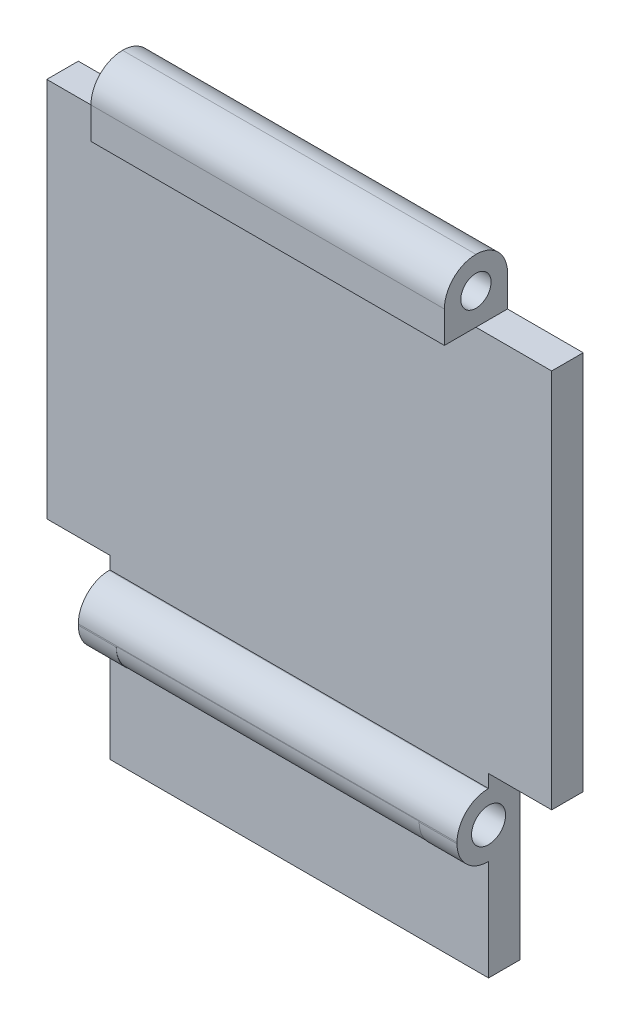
ISO-10303-21;
HEADER;
FILE_DESCRIPTION(('STEP AP214'),'2;1');
FILE_NAME('part.step','',(''),(''),'','','');
FILE_SCHEMA(('AUTOMOTIVE_DESIGN { 1 0 10303 214 1 1 1 1 }'));
ENDSEC;
DATA;
#1=APPLICATION_CONTEXT('core data for automotive mechanical design processes');
#2=APPLICATION_PROTOCOL_DEFINITION('international standard','automotive_design',2000,#1);
#3=PRODUCT_CONTEXT('',#1,'mechanical');
#4=PRODUCT('Part','Part','',(#3));
#5=PRODUCT_RELATED_PRODUCT_CATEGORY('part','',(#4));
#6=PRODUCT_DEFINITION_FORMATION('','',#4);
#7=PRODUCT_DEFINITION_CONTEXT('part definition',#1,'design');
#8=PRODUCT_DEFINITION('design','',#6,#7);
#9=PRODUCT_DEFINITION_SHAPE('','',#8);
#10=(LENGTH_UNIT() NAMED_UNIT(*) SI_UNIT(.MILLI.,.METRE.));
#11=(NAMED_UNIT(*) PLANE_ANGLE_UNIT() SI_UNIT($,.RADIAN.));
#12=(NAMED_UNIT(*) SI_UNIT($,.STERADIAN.) SOLID_ANGLE_UNIT());
#13=UNCERTAINTY_MEASURE_WITH_UNIT(LENGTH_MEASURE(1.E-05),#10,'distance_accuracy_value','');
#14=(GEOMETRIC_REPRESENTATION_CONTEXT(3) GLOBAL_UNCERTAINTY_ASSIGNED_CONTEXT((#13)) GLOBAL_UNIT_ASSIGNED_CONTEXT((#10,
#11,#12)) REPRESENTATION_CONTEXT('',''));
#15=CARTESIAN_POINT('',(0.,0.,0.));
#16=DIRECTION('',(0.,0.,1.));
#17=DIRECTION('',(1.,0.,0.));
#18=AXIS2_PLACEMENT_3D('',#15,#16,#17);
#19=CARTESIAN_POINT('',(12.,-10.5439596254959,2.5));
#20=DIRECTION('',(0.,1.,0.));
#21=DIRECTION('',(0.,0.,1.));
#22=AXIS2_PLACEMENT_3D('',#19,#20,#21);
#23=PLANE('',#22);
#24=DIRECTION('',(0.,0.,1.));
#25=VECTOR('',#24,1.);
#26=CARTESIAN_POINT('',(15.,-10.5439596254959,2.5));
#27=LINE('',#26,#25);
#28=CARTESIAN_POINT('',(15.,-10.5439596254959,0.));
#29=VERTEX_POINT('',#28);
#30=CARTESIAN_POINT('',(15.,-10.5439596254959,2.5));
#31=VERTEX_POINT('',#30);
#32=EDGE_CURVE('E277',#29,#31,#27,.T.);
#33=ORIENTED_EDGE('',*,*,#32,.F.);
#34=DIRECTION('',(-1.,0.,0.));
#35=VECTOR('',#34,1.);
#36=CARTESIAN_POINT('',(0.,-10.5439596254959,0.));
#37=LINE('',#36,#35);
#38=CARTESIAN_POINT('',(20.,-10.5439596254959,0.));
#39=VERTEX_POINT('',#38);
#40=EDGE_CURVE('E332',#39,#29,#37,.T.);
#41=ORIENTED_EDGE('',*,*,#40,.F.);
#42=DIRECTION('',(0.,0.,1.));
#43=VECTOR('',#42,1.);
#44=CARTESIAN_POINT('',(20.,-10.5439596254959,2.5));
#45=LINE('',#44,#43);
#46=CARTESIAN_POINT('',(20.,-10.5439596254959,2.5));
#47=VERTEX_POINT('',#46);
#48=EDGE_CURVE('E327',#39,#47,#45,.T.);
#49=ORIENTED_EDGE('',*,*,#48,.T.);
#50=DIRECTION('',(1.,0.,0.));
#51=VECTOR('',#50,1.);
#52=CARTESIAN_POINT('',(12.,-10.5439596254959,2.5));
#53=LINE('',#52,#51);
#54=EDGE_CURVE('E330',#31,#47,#53,.T.);
#55=ORIENTED_EDGE('',*,*,#54,.F.);
#56=EDGE_LOOP('',(#33,#41,#49,#55));
#57=FACE_BOUND('',#56,.T.);
#58=ADVANCED_FACE('F37',(#57),#23,.F.);
#59=CARTESIAN_POINT('',(0.,0.,2.5));
#60=DIRECTION('',(0.,0.,1.));
#61=DIRECTION('',(1.,0.,0.));
#62=AXIS2_PLACEMENT_3D('',#59,#60,#61);
#63=PLANE('',#62);
#64=DIRECTION('',(1.,0.,0.));
#65=VECTOR('',#64,1.);
#66=CARTESIAN_POINT('',(20.,-24.575,2.5));
#67=LINE('',#66,#65);
#68=CARTESIAN_POINT('',(-15.,-24.575,2.5));
#69=VERTEX_POINT('',#68);
#70=CARTESIAN_POINT('',(15.,-24.575,2.5));
#71=VERTEX_POINT('',#70);
#72=EDGE_CURVE('E236',#69,#71,#67,.T.);
#73=ORIENTED_EDGE('',*,*,#72,.T.);
#74=DIRECTION('',(0.,-1.,0.));
#75=VECTOR('',#74,1.);
#76=CARTESIAN_POINT('',(15.,-24.575,2.5));
#77=LINE('',#76,#75);
#78=CARTESIAN_POINT('',(15.,-16.575,2.5));
#79=VERTEX_POINT('',#78);
#80=EDGE_CURVE('E291',#79,#71,#77,.T.);
#81=ORIENTED_EDGE('',*,*,#80,.F.);
#82=DIRECTION('',(-1.,0.,0.));
#83=VECTOR('',#82,1.);
#84=CARTESIAN_POINT('',(15.,-16.575,2.5));
#85=LINE('',#84,#83);
#86=CARTESIAN_POINT('',(12.,-16.575,2.5));
#87=VERTEX_POINT('',#86);
#88=EDGE_CURVE('E296',#79,#87,#85,.T.);
#89=ORIENTED_EDGE('',*,*,#88,.T.);
#90=DIRECTION('',(1.,0.,0.));
#91=VECTOR('',#90,1.);
#92=CARTESIAN_POINT('',(0.,-16.575,2.5));
#93=LINE('',#92,#91);
#94=CARTESIAN_POINT('',(-12.,-16.575,2.5));
#95=VERTEX_POINT('',#94);
#96=EDGE_CURVE('E317',#95,#87,#93,.T.);
#97=ORIENTED_EDGE('',*,*,#96,.F.);
#98=DIRECTION('',(1.,0.,0.));
#99=VECTOR('',#98,1.);
#100=CARTESIAN_POINT('',(-15.,-16.575,2.5));
#101=LINE('',#100,#99);
#102=CARTESIAN_POINT('',(-15.,-16.575,2.5));
#103=VERTEX_POINT('',#102);
#104=EDGE_CURVE('E269',#103,#95,#101,.T.);
#105=ORIENTED_EDGE('',*,*,#104,.F.);
#106=DIRECTION('',(0.,1.,0.));
#107=VECTOR('',#106,1.);
#108=CARTESIAN_POINT('',(-15.,-24.575,2.5));
#109=LINE('',#108,#107);
#110=EDGE_CURVE('E239',#69,#103,#109,.T.);
#111=ORIENTED_EDGE('',*,*,#110,.F.);
#112=EDGE_LOOP('',(#73,#81,#89,#97,#105,#111));
#113=FACE_BOUND('',#112,.T.);
#114=ADVANCED_FACE('F461',(#113),#63,.T.);
#115=CARTESIAN_POINT('',(20.,-24.575,5.));
#116=DIRECTION('',(-1.,0.,0.));
#117=DIRECTION('',(0.,0.,1.));
#118=AXIS2_PLACEMENT_3D('',#115,#116,#117);
#119=PLANE('',#118);
#120=DIRECTION('',(0.,1.,0.));
#121=VECTOR('',#120,1.);
#122=CARTESIAN_POINT('',(20.,19.575,2.5));
#123=LINE('',#122,#121);
#124=CARTESIAN_POINT('',(20.,19.575,2.5));
#125=VERTEX_POINT('',#124);
#126=EDGE_CURVE('E351',#47,#125,#123,.T.);
#127=ORIENTED_EDGE('',*,*,#126,.F.);
#128=ORIENTED_EDGE('',*,*,#48,.F.);
#129=DIRECTION('',(0.,1.,0.));
#130=VECTOR('',#129,1.);
#131=CARTESIAN_POINT('',(20.,-24.575,0.));
#132=LINE('',#131,#130);
#133=CARTESIAN_POINT('',(20.,19.575,0.));
#134=VERTEX_POINT('',#133);
#135=EDGE_CURVE('E230',#39,#134,#132,.T.);
#136=ORIENTED_EDGE('',*,*,#135,.T.);
#137=DIRECTION('',(0.,0.,-1.));
#138=VECTOR('',#137,1.);
#139=CARTESIAN_POINT('',(20.,19.575,5.));
#140=LINE('',#139,#138);
#141=EDGE_CURVE('E380',#125,#134,#140,.T.);
#142=ORIENTED_EDGE('',*,*,#141,.F.);
#143=EDGE_LOOP('',(#127,#128,#136,#142));
#144=FACE_BOUND('',#143,.T.);
#145=ADVANCED_FACE('F543',(#144),#119,.F.);
#146=CARTESIAN_POINT('',(20.,-24.575,5.));
#147=DIRECTION('',(0.,1.,0.));
#148=DIRECTION('',(-1.,0.,0.));
#149=AXIS2_PLACEMENT_3D('',#146,#147,#148);
#150=PLANE('',#149);
#151=DIRECTION('',(1.,0.,0.));
#152=VECTOR('',#151,1.);
#153=CARTESIAN_POINT('',(20.,-24.575,0.));
#154=LINE('',#153,#152);
#155=CARTESIAN_POINT('',(-15.,-24.575,0.));
#156=VERTEX_POINT('',#155);
#157=CARTESIAN_POINT('',(15.,-24.575,0.));
#158=VERTEX_POINT('',#157);
#159=EDGE_CURVE('E219',#156,#158,#154,.T.);
#160=ORIENTED_EDGE('',*,*,#159,.T.);
#161=DIRECTION('',(0.,0.,-1.));
#162=VECTOR('',#161,1.);
#163=CARTESIAN_POINT('',(15.,-24.575,0.));
#164=LINE('',#163,#162);
#165=EDGE_CURVE('E294',#71,#158,#164,.T.);
#166=ORIENTED_EDGE('',*,*,#165,.F.);
#167=ORIENTED_EDGE('',*,*,#72,.F.);
#168=DIRECTION('',(0.,0.,1.));
#169=VECTOR('',#168,1.);
#170=CARTESIAN_POINT('',(-15.,-24.575,0.));
#171=LINE('',#170,#169);
#172=EDGE_CURVE('E234',#156,#69,#171,.T.);
#173=ORIENTED_EDGE('',*,*,#172,.F.);
#174=EDGE_LOOP('',(#160,#166,#167,#173));
#175=FACE_BOUND('',#174,.T.);
#176=ADVANCED_FACE('F235',(#175),#150,.F.);
#177=CARTESIAN_POINT('',(20.,19.575,5.));
#178=DIRECTION('',(0.,1.,0.));
#179=DIRECTION('',(0.,0.,1.));
#180=AXIS2_PLACEMENT_3D('',#177,#178,#179);
#181=PLANE('',#180);
#182=DIRECTION('',(0.,0.,-1.));
#183=VECTOR('',#182,1.);
#184=CARTESIAN_POINT('',(14.,19.575,5.));
#185=LINE('',#184,#183);
#186=CARTESIAN_POINT('',(14.,19.575,2.5));
#187=VERTEX_POINT('',#186);
#188=CARTESIAN_POINT('',(14.,19.575,0.));
#189=VERTEX_POINT('',#188);
#190=EDGE_CURVE('E388',#187,#189,#185,.T.);
#191=ORIENTED_EDGE('',*,*,#190,.F.);
#192=DIRECTION('',(-1.,0.,0.));
#193=VECTOR('',#192,1.);
#194=CARTESIAN_POINT('',(20.,19.575,2.5));
#195=LINE('',#194,#193);
#196=EDGE_CURVE('E343',#125,#187,#195,.T.);
#197=ORIENTED_EDGE('',*,*,#196,.F.);
#198=ORIENTED_EDGE('',*,*,#141,.T.);
#199=DIRECTION('',(1.,0.,0.));
#200=VECTOR('',#199,1.);
#201=CARTESIAN_POINT('',(20.,19.575,0.));
#202=LINE('',#201,#200);
#203=EDGE_CURVE('E381',#189,#134,#202,.T.);
#204=ORIENTED_EDGE('',*,*,#203,.F.);
#205=EDGE_LOOP('',(#191,#197,#198,#204));
#206=FACE_BOUND('',#205,.T.);
#207=ADVANCED_FACE('F539',(#206),#181,.T.);
#208=CARTESIAN_POINT('',(-20.,-24.575,5.));
#209=DIRECTION('',(1.,0.,0.));
#210=DIRECTION('',(0.,0.,-1.));
#211=AXIS2_PLACEMENT_3D('',#208,#209,#210);
#212=PLANE('',#211);
#213=DIRECTION('',(0.,-1.,0.));
#214=VECTOR('',#213,1.);
#215=CARTESIAN_POINT('',(-20.,-24.575,0.));
#216=LINE('',#215,#214);
#217=CARTESIAN_POINT('',(-20.,19.5799216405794,0.));
#218=VERTEX_POINT('',#217);
#219=CARTESIAN_POINT('',(-20.,-10.575,0.));
#220=VERTEX_POINT('',#219);
#221=EDGE_CURVE('E231',#218,#220,#216,.T.);
#222=ORIENTED_EDGE('',*,*,#221,.T.);
#223=DIRECTION('',(0.,0.,-1.));
#224=VECTOR('',#223,1.);
#225=CARTESIAN_POINT('',(-20.,-10.575,2.49999999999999));
#226=LINE('',#225,#224);
#227=CARTESIAN_POINT('',(-20.,-10.575,2.49999999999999));
#228=VERTEX_POINT('',#227);
#229=EDGE_CURVE('E320',#228,#220,#226,.T.);
#230=ORIENTED_EDGE('',*,*,#229,.F.);
#231=DIRECTION('',(0.,-1.,0.));
#232=VECTOR('',#231,1.);
#233=CARTESIAN_POINT('',(-19.9999995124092,19.575,2.5));
#234=LINE('',#233,#232);
#235=CARTESIAN_POINT('',(-20.,19.5799216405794,2.5));
#236=VERTEX_POINT('',#235);
#237=EDGE_CURVE('E346',#236,#228,#234,.T.);
#238=ORIENTED_EDGE('',*,*,#237,.F.);
#239=DIRECTION('',(0.,0.,-1.));
#240=VECTOR('',#239,1.);
#241=CARTESIAN_POINT('',(-20.,19.5799216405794,5.));
#242=LINE('',#241,#240);
#243=EDGE_CURVE('E375',#236,#218,#242,.T.);
#244=ORIENTED_EDGE('',*,*,#243,.T.);
#245=EDGE_LOOP('',(#222,#230,#238,#244));
#246=FACE_BOUND('',#245,.T.);
#247=ADVANCED_FACE('F502',(#246),#212,.F.);
#248=CARTESIAN_POINT('',(0.,0.,5.));
#249=DIRECTION('',(0.,0.,1.));
#250=DIRECTION('',(1.,0.,0.));
#251=AXIS2_PLACEMENT_3D('',#248,#249,#250);
#252=PLANE('',#251);
#253=DIRECTION('',(0.,1.,0.));
#254=VECTOR('',#253,1.);
#255=CARTESIAN_POINT('',(-14.,24.575,5.));
#256=LINE('',#255,#254);
#257=CARTESIAN_POINT('',(-14.,19.575,5.));
#258=VERTEX_POINT('',#257);
#259=CARTESIAN_POINT('',(-14.,22.075,5.));
#260=VERTEX_POINT('',#259);
#261=EDGE_CURVE('E363',#258,#260,#256,.T.);
#262=ORIENTED_EDGE('',*,*,#261,.F.);
#263=DIRECTION('',(-1.,0.,0.));
#264=VECTOR('',#263,1.);
#265=CARTESIAN_POINT('',(20.,19.575,5.));
#266=LINE('',#265,#264);
#267=CARTESIAN_POINT('',(14.,19.575,5.));
#268=VERTEX_POINT('',#267);
#269=EDGE_CURVE('E342',#268,#258,#266,.T.);
#270=ORIENTED_EDGE('',*,*,#269,.F.);
#271=DIRECTION('',(0.,-1.,0.));
#272=VECTOR('',#271,1.);
#273=CARTESIAN_POINT('',(14.,24.575,5.));
#274=LINE('',#273,#272);
#275=CARTESIAN_POINT('',(14.,22.075,5.));
#276=VERTEX_POINT('',#275);
#277=EDGE_CURVE('E377',#276,#268,#274,.T.);
#278=ORIENTED_EDGE('',*,*,#277,.F.);
#279=DIRECTION('',(-1.,0.,0.));
#280=VECTOR('',#279,1.);
#281=CARTESIAN_POINT('',(-14.,22.075,5.));
#282=LINE('',#281,#280);
#283=EDGE_CURVE('E394',#276,#260,#282,.T.);
#284=ORIENTED_EDGE('',*,*,#283,.T.);
#285=EDGE_LOOP('',(#262,#270,#278,#284));
#286=FACE_BOUND('',#285,.T.);
#287=ADVANCED_FACE('F529',(#286),#252,.T.);
#288=CARTESIAN_POINT('',(0.,0.,0.));
#289=DIRECTION('',(0.,0.,1.));
#290=DIRECTION('',(1.,0.,0.));
#291=AXIS2_PLACEMENT_3D('',#288,#289,#290);
#292=PLANE('',#291);
#293=DIRECTION('',(0.,-1.,0.));
#294=VECTOR('',#293,1.);
#295=CARTESIAN_POINT('',(-15.,-10.575,0.));
#296=LINE('',#295,#294);
#297=CARTESIAN_POINT('',(-15.,-10.575,0.));
#298=VERTEX_POINT('',#297);
#299=EDGE_CURVE('E223',#298,#156,#296,.T.);
#300=ORIENTED_EDGE('',*,*,#299,.F.);
#301=DIRECTION('',(-1.,0.,0.));
#302=VECTOR('',#301,1.);
#303=CARTESIAN_POINT('',(0.,-10.575,0.));
#304=LINE('',#303,#302);
#305=EDGE_CURVE('E325',#298,#220,#304,.T.);
#306=ORIENTED_EDGE('',*,*,#305,.T.);
#307=ORIENTED_EDGE('',*,*,#221,.F.);
#308=DIRECTION('',(1.,0.,0.));
#309=VECTOR('',#308,1.);
#310=CARTESIAN_POINT('',(-20.,19.5799216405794,0.));
#311=LINE('',#310,#309);
#312=CARTESIAN_POINT('',(-14.,19.5799216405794,0.));
#313=VERTEX_POINT('',#312);
#314=EDGE_CURVE('E368',#218,#313,#311,.T.);
#315=ORIENTED_EDGE('',*,*,#314,.T.);
#316=DIRECTION('',(0.,1.,0.));
#317=VECTOR('',#316,1.);
#318=CARTESIAN_POINT('',(-14.,24.575,0.));
#319=LINE('',#318,#317);
#320=CARTESIAN_POINT('',(-14.,22.075,0.));
#321=VERTEX_POINT('',#320);
#322=EDGE_CURVE('E367',#313,#321,#319,.T.);
#323=ORIENTED_EDGE('',*,*,#322,.T.);
#324=DIRECTION('',(-1.,0.,0.));
#325=VECTOR('',#324,1.);
#326=CARTESIAN_POINT('',(0.,22.075,0.));
#327=LINE('',#326,#325);
#328=CARTESIAN_POINT('',(14.,22.075,0.));
#329=VERTEX_POINT('',#328);
#330=EDGE_CURVE('E405',#321,#329,#327,.F.);
#331=ORIENTED_EDGE('',*,*,#330,.T.);
#332=DIRECTION('',(0.,-1.,0.));
#333=VECTOR('',#332,1.);
#334=CARTESIAN_POINT('',(14.,24.575,0.));
#335=LINE('',#334,#333);
#336=EDGE_CURVE('E362',#329,#189,#335,.T.);
#337=ORIENTED_EDGE('',*,*,#336,.T.);
#338=ORIENTED_EDGE('',*,*,#203,.T.);
#339=ORIENTED_EDGE('',*,*,#135,.F.);
#340=ORIENTED_EDGE('',*,*,#40,.T.);
#341=DIRECTION('',(0.,1.,0.));
#342=VECTOR('',#341,1.);
#343=CARTESIAN_POINT('',(15.,-10.5439596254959,0.));
#344=LINE('',#343,#342);
#345=EDGE_CURVE('E226',#158,#29,#344,.T.);
#346=ORIENTED_EDGE('',*,*,#345,.F.);
#347=ORIENTED_EDGE('',*,*,#159,.F.);
#348=EDGE_LOOP('',(#300,#306,#307,#315,#323,#331,#337,#338,#339,#340,#346,#347));
#349=FACE_BOUND('',#348,.T.);
#350=ADVANCED_FACE('F221',(#349),#292,.F.);
#351=CARTESIAN_POINT('',(14.,24.575,5.));
#352=DIRECTION('',(1.,0.,0.));
#353=DIRECTION('',(0.,1.,0.));
#354=AXIS2_PLACEMENT_3D('',#351,#352,#353);
#355=PLANE('',#354);
#356=CARTESIAN_POINT('',(14.,22.075,2.5));
#357=DIRECTION('',(1.,0.,0.));
#358=DIRECTION('',(0.,1.,0.));
#359=AXIS2_PLACEMENT_3D('',#356,#357,#358);
#360=CIRCLE('',#359,1.2);
#361=CARTESIAN_POINT('',(14.,23.275,2.5));
#362=VERTEX_POINT('',#361);
#363=EDGE_CURVE('E359',#362,#362,#360,.T.);
#364=ORIENTED_EDGE('',*,*,#363,.F.);
#365=EDGE_LOOP('',(#364));
#366=FACE_BOUND('',#365,.T.);
#367=CARTESIAN_POINT('',(14.,22.075,2.5));
#368=DIRECTION('',(1.,0.,0.));
#369=DIRECTION('',(0.,1.,0.));
#370=AXIS2_PLACEMENT_3D('',#367,#368,#369);
#371=CIRCLE('',#370,2.5);
#372=CARTESIAN_POINT('',(14.,24.575,2.5));
#373=VERTEX_POINT('',#372);
#374=EDGE_CURVE('E401',#329,#373,#371,.T.);
#375=ORIENTED_EDGE('',*,*,#374,.T.);
#376=CARTESIAN_POINT('',(14.,22.075,2.5));
#377=DIRECTION('',(1.,0.,0.));
#378=DIRECTION('',(0.,1.,0.));
#379=AXIS2_PLACEMENT_3D('',#376,#377,#378);
#380=CIRCLE('',#379,2.5);
#381=EDGE_CURVE('E403',#373,#276,#380,.T.);
#382=ORIENTED_EDGE('',*,*,#381,.T.);
#383=ORIENTED_EDGE('',*,*,#277,.T.);
#384=EDGE_CURVE('E371',#268,#187,#185,.T.);
#385=ORIENTED_EDGE('',*,*,#384,.T.);
#386=ORIENTED_EDGE('',*,*,#190,.T.);
#387=ORIENTED_EDGE('',*,*,#336,.F.);
#388=EDGE_LOOP('',(#375,#382,#383,#385,#386,#387));
#389=FACE_BOUND('',#388,.T.);
#390=ADVANCED_FACE('F525',(#366,#389),#355,.T.);
#391=CARTESIAN_POINT('',(-20.,19.5799216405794,5.));
#392=DIRECTION('',(0.,1.,0.));
#393=DIRECTION('',(0.,0.,1.));
#394=AXIS2_PLACEMENT_3D('',#391,#392,#393);
#395=PLANE('',#394);
#396=DIRECTION('',(-1.,0.,0.));
#397=VECTOR('',#396,1.);
#398=CARTESIAN_POINT('',(-20.,19.5799216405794,2.5));
#399=LINE('',#398,#397);
#400=CARTESIAN_POINT('',(-14.,19.5799216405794,2.5));
#401=VERTEX_POINT('',#400);
#402=EDGE_CURVE('E334',#401,#236,#399,.T.);
#403=ORIENTED_EDGE('',*,*,#402,.F.);
#404=DIRECTION('',(0.,0.,-1.));
#405=VECTOR('',#404,1.);
#406=CARTESIAN_POINT('',(-14.,19.5799216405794,5.));
#407=LINE('',#406,#405);
#408=EDGE_CURVE('E366',#401,#313,#407,.T.);
#409=ORIENTED_EDGE('',*,*,#408,.T.);
#410=ORIENTED_EDGE('',*,*,#314,.F.);
#411=ORIENTED_EDGE('',*,*,#243,.F.);
#412=EDGE_LOOP('',(#403,#409,#410,#411));
#413=FACE_BOUND('',#412,.T.);
#414=ADVANCED_FACE('F510',(#413),#395,.T.);
#415=CARTESIAN_POINT('',(-14.,24.575,5.));
#416=DIRECTION('',(-1.,0.,0.));
#417=DIRECTION('',(0.,-1.,0.));
#418=AXIS2_PLACEMENT_3D('',#415,#416,#417);
#419=PLANE('',#418);
#420=CARTESIAN_POINT('',(-14.,22.075,2.5));
#421=DIRECTION('',(-1.,0.,0.));
#422=DIRECTION('',(0.,0.,1.));
#423=AXIS2_PLACEMENT_3D('',#420,#421,#422);
#424=CIRCLE('',#423,1.2);
#425=CARTESIAN_POINT('',(-14.,22.075,3.7));
#426=VERTEX_POINT('',#425);
#427=EDGE_CURVE('E356',#426,#426,#424,.T.);
#428=ORIENTED_EDGE('',*,*,#427,.F.);
#429=EDGE_LOOP('',(#428));
#430=FACE_BOUND('',#429,.T.);
#431=ORIENTED_EDGE('',*,*,#261,.T.);
#432=CARTESIAN_POINT('',(-14.,22.075,2.5));
#433=DIRECTION('',(-1.,0.,0.));
#434=DIRECTION('',(0.,-1.,0.));
#435=AXIS2_PLACEMENT_3D('',#432,#433,#434);
#436=CIRCLE('',#435,2.5);
#437=CARTESIAN_POINT('',(-14.,24.575,2.5));
#438=VERTEX_POINT('',#437);
#439=EDGE_CURVE('E399',#260,#438,#436,.T.);
#440=ORIENTED_EDGE('',*,*,#439,.T.);
#441=CARTESIAN_POINT('',(-14.,22.075,2.5));
#442=DIRECTION('',(-1.,0.,0.));
#443=DIRECTION('',(0.,-1.,0.));
#444=AXIS2_PLACEMENT_3D('',#441,#442,#443);
#445=CIRCLE('',#444,2.5);
#446=EDGE_CURVE('E397',#438,#321,#445,.T.);
#447=ORIENTED_EDGE('',*,*,#446,.T.);
#448=ORIENTED_EDGE('',*,*,#322,.F.);
#449=ORIENTED_EDGE('',*,*,#408,.F.);
#450=DIRECTION('',(0.,1.,0.));
#451=VECTOR('',#450,1.);
#452=CARTESIAN_POINT('',(-14.,19.5699216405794,2.5));
#453=LINE('',#452,#451);
#454=CARTESIAN_POINT('',(-14.,19.575,2.5));
#455=VERTEX_POINT('',#454);
#456=EDGE_CURVE('E337',#455,#401,#453,.T.);
#457=ORIENTED_EDGE('',*,*,#456,.F.);
#458=DIRECTION('',(0.,0.,-1.));
#459=VECTOR('',#458,1.);
#460=CARTESIAN_POINT('',(-14.,19.575,2.49999999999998));
#461=LINE('',#460,#459);
#462=EDGE_CURVE('E339',#258,#455,#461,.T.);
#463=ORIENTED_EDGE('',*,*,#462,.F.);
#464=EDGE_LOOP('',(#431,#440,#447,#448,#449,#457,#463));
#465=FACE_BOUND('',#464,.T.);
#466=ADVANCED_FACE('F513',(#430,#465),#419,.T.);
#467=CARTESIAN_POINT('',(18.,22.075,2.5));
#468=DIRECTION('',(-1.,0.,0.));
#469=DIRECTION('',(0.,0.,1.));
#470=AXIS2_PLACEMENT_3D('',#467,#468,#469);
#471=CYLINDRICAL_SURFACE('',#470,1.2);
#472=ORIENTED_EDGE('',*,*,#363,.T.);
#473=EDGE_LOOP('',(#472));
#474=FACE_BOUND('',#473,.T.);
#475=ORIENTED_EDGE('',*,*,#427,.T.);
#476=EDGE_LOOP('',(#475));
#477=FACE_BOUND('',#476,.T.);
#478=ADVANCED_FACE('F583',(#474,#477),#471,.F.);
#479=CARTESIAN_POINT('',(20.,22.075,2.5));
#480=DIRECTION('',(-1.,0.,0.));
#481=DIRECTION('',(0.,-1.,0.));
#482=AXIS2_PLACEMENT_3D('',#479,#480,#481);
#483=CYLINDRICAL_SURFACE('',#482,2.5);
#484=DIRECTION('',(-1.,0.,0.));
#485=VECTOR('',#484,1.);
#486=CARTESIAN_POINT('',(20.,24.575,2.5));
#487=LINE('',#486,#485);
#488=EDGE_CURVE('E353',#373,#438,#487,.T.);
#489=ORIENTED_EDGE('',*,*,#488,.F.);
#490=ORIENTED_EDGE('',*,*,#374,.F.);
#491=ORIENTED_EDGE('',*,*,#330,.F.);
#492=ORIENTED_EDGE('',*,*,#446,.F.);
#493=EDGE_LOOP('',(#489,#490,#491,#492));
#494=FACE_BOUND('',#493,.T.);
#495=ADVANCED_FACE('F517',(#494),#483,.T.);
#496=CARTESIAN_POINT('',(0.,22.075,2.5));
#497=DIRECTION('',(1.,0.,0.));
#498=DIRECTION('',(0.,1.,0.));
#499=AXIS2_PLACEMENT_3D('',#496,#497,#498);
#500=CYLINDRICAL_SURFACE('',#499,2.5);
#501=ORIENTED_EDGE('',*,*,#381,.F.);
#502=ORIENTED_EDGE('',*,*,#488,.T.);
#503=ORIENTED_EDGE('',*,*,#439,.F.);
#504=ORIENTED_EDGE('',*,*,#283,.F.);
#505=EDGE_LOOP('',(#501,#502,#503,#504));
#506=FACE_BOUND('',#505,.T.);
#507=ADVANCED_FACE('F521',(#506),#500,.T.);
#508=CARTESIAN_POINT('',(20.,19.575,2.5));
#509=DIRECTION('',(0.,1.,0.));
#510=DIRECTION('',(-1.,0.,0.));
#511=AXIS2_PLACEMENT_3D('',#508,#509,#510);
#512=PLANE('',#511);
#513=ORIENTED_EDGE('',*,*,#269,.T.);
#514=ORIENTED_EDGE('',*,*,#462,.T.);
#515=EDGE_CURVE('E347',#187,#455,#195,.T.);
#516=ORIENTED_EDGE('',*,*,#515,.F.);
#517=ORIENTED_EDGE('',*,*,#384,.F.);
#518=EDGE_LOOP('',(#513,#514,#516,#517));
#519=FACE_BOUND('',#518,.T.);
#520=ADVANCED_FACE('F532',(#519),#512,.F.);
#521=DIRECTION('',(-1.,0.,0.));
#522=VECTOR('',#521,1.);
#523=CARTESIAN_POINT('',(-12.,-10.575,2.49999999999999));
#524=LINE('',#523,#522);
#525=CARTESIAN_POINT('',(-15.,-10.575,2.49999999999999));
#526=VERTEX_POINT('',#525);
#527=EDGE_CURVE('E323',#526,#228,#524,.T.);
#528=ORIENTED_EDGE('',*,*,#527,.F.);
#529=DIRECTION('',(0.,1.,0.));
#530=VECTOR('',#529,1.);
#531=CARTESIAN_POINT('',(-15.,-11.5775410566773,2.5));
#532=LINE('',#531,#530);
#533=CARTESIAN_POINT('',(-15.,-11.5775410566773,2.5));
#534=VERTEX_POINT('',#533);
#535=EDGE_CURVE('E260',#534,#526,#532,.T.);
#536=ORIENTED_EDGE('',*,*,#535,.F.);
#537=DIRECTION('',(1.,0.,0.));
#538=VECTOR('',#537,1.);
#539=CARTESIAN_POINT('',(-15.,-11.5775410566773,2.5));
#540=LINE('',#539,#538);
#541=CARTESIAN_POINT('',(-12.,-11.5775410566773,2.5));
#542=VERTEX_POINT('',#541);
#543=EDGE_CURVE('E263',#534,#542,#540,.T.);
#544=ORIENTED_EDGE('',*,*,#543,.T.);
#545=DIRECTION('',(-1.,0.,0.));
#546=VECTOR('',#545,1.);
#547=CARTESIAN_POINT('',(0.,-11.5775410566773,2.5));
#548=LINE('',#547,#546);
#549=CARTESIAN_POINT('',(12.,-11.5775410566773,2.5));
#550=VERTEX_POINT('',#549);
#551=EDGE_CURVE('E312',#550,#542,#548,.T.);
#552=ORIENTED_EDGE('',*,*,#551,.F.);
#553=DIRECTION('',(-1.,0.,0.));
#554=VECTOR('',#553,1.);
#555=CARTESIAN_POINT('',(15.,-11.5775410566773,2.5));
#556=LINE('',#555,#554);
#557=CARTESIAN_POINT('',(15.,-11.5775410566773,2.5));
#558=VERTEX_POINT('',#557);
#559=EDGE_CURVE('E305',#558,#550,#556,.T.);
#560=ORIENTED_EDGE('',*,*,#559,.F.);
#561=DIRECTION('',(0.,-1.,0.));
#562=VECTOR('',#561,1.);
#563=CARTESIAN_POINT('',(15.,-11.5775410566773,2.5));
#564=LINE('',#563,#562);
#565=EDGE_CURVE('E281',#31,#558,#564,.T.);
#566=ORIENTED_EDGE('',*,*,#565,.F.);
#567=ORIENTED_EDGE('',*,*,#54,.T.);
#568=ORIENTED_EDGE('',*,*,#126,.T.);
#569=ORIENTED_EDGE('',*,*,#196,.T.);
#570=ORIENTED_EDGE('',*,*,#515,.T.);
#571=ORIENTED_EDGE('',*,*,#456,.T.);
#572=ORIENTED_EDGE('',*,*,#402,.T.);
#573=ORIENTED_EDGE('',*,*,#237,.T.);
#574=EDGE_LOOP('',(#528,#536,#544,#552,#560,#566,#567,#568,#569,#570,#571,#572,#573));
#575=FACE_BOUND('',#574,.T.);
#576=ADVANCED_FACE('F497',(#575),#63,.T.);
#577=CARTESIAN_POINT('',(-12.,-10.575,2.49999999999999));
#578=DIRECTION('',(0.,1.,0.));
#579=DIRECTION('',(0.,0.,1.));
#580=AXIS2_PLACEMENT_3D('',#577,#578,#579);
#581=PLANE('',#580);
#582=ORIENTED_EDGE('',*,*,#305,.F.);
#583=DIRECTION('',(0.,0.,-1.));
#584=VECTOR('',#583,1.);
#585=CARTESIAN_POINT('',(-15.,-10.575,2.49999999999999));
#586=LINE('',#585,#584);
#587=EDGE_CURVE('E245',#526,#298,#586,.T.);
#588=ORIENTED_EDGE('',*,*,#587,.F.);
#589=ORIENTED_EDGE('',*,*,#527,.T.);
#590=ORIENTED_EDGE('',*,*,#229,.T.);
#591=EDGE_LOOP('',(#582,#588,#589,#590));
#592=FACE_BOUND('',#591,.T.);
#593=ADVANCED_FACE('F500',(#592),#581,.F.);
#594=CARTESIAN_POINT('',(-12.,-16.575,5.));
#595=DIRECTION('',(0.,0.,1.));
#596=DIRECTION('',(1.,0.,0.));
#597=AXIS2_PLACEMENT_3D('',#594,#595,#596);
#598=PLANE('',#597);
#599=DIRECTION('',(0.,1.,0.));
#600=VECTOR('',#599,1.);
#601=CARTESIAN_POINT('',(-15.,-16.575,5.));
#602=LINE('',#601,#600);
#603=CARTESIAN_POINT('',(-15.,-14.125,5.));
#604=VERTEX_POINT('',#603);
#605=CARTESIAN_POINT('',(-15.,-14.0275122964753,5.));
#606=VERTEX_POINT('',#605);
#607=EDGE_CURVE('E256',#604,#606,#602,.T.);
#608=ORIENTED_EDGE('',*,*,#607,.F.);
#609=DIRECTION('',(1.,0.,0.));
#610=VECTOR('',#609,1.);
#611=CARTESIAN_POINT('',(-12.,-14.125,5.));
#612=LINE('',#611,#610);
#613=CARTESIAN_POINT('',(-12.,-14.125,5.));
#614=VERTEX_POINT('',#613);
#615=EDGE_CURVE('E444',#604,#614,#612,.T.);
#616=ORIENTED_EDGE('',*,*,#615,.T.);
#617=DIRECTION('',(0.,1.,0.));
#618=VECTOR('',#617,1.);
#619=CARTESIAN_POINT('',(-12.,-16.575,5.));
#620=LINE('',#619,#618);
#621=CARTESIAN_POINT('',(-12.,-14.075,5.));
#622=VERTEX_POINT('',#621);
#623=EDGE_CURVE('E248',#614,#622,#620,.T.);
#624=ORIENTED_EDGE('',*,*,#623,.T.);
#625=DIRECTION('',(1.,0.,0.));
#626=VECTOR('',#625,1.);
#627=CARTESIAN_POINT('',(-12.,-14.075,5.));
#628=LINE('',#627,#626);
#629=CARTESIAN_POINT('',(12.,-14.075,5.));
#630=VERTEX_POINT('',#629);
#631=EDGE_CURVE('E412',#622,#630,#628,.T.);
#632=ORIENTED_EDGE('',*,*,#631,.T.);
#633=DIRECTION('',(0.,-1.,0.));
#634=VECTOR('',#633,1.);
#635=CARTESIAN_POINT('',(12.,-16.575,5.));
#636=LINE('',#635,#634);
#637=CARTESIAN_POINT('',(12.,-14.125,5.));
#638=VERTEX_POINT('',#637);
#639=EDGE_CURVE('E299',#630,#638,#636,.T.);
#640=ORIENTED_EDGE('',*,*,#639,.T.);
#641=DIRECTION('',(-1.,0.,0.));
#642=VECTOR('',#641,1.);
#643=CARTESIAN_POINT('',(15.,-14.125,5.));
#644=LINE('',#643,#642);
#645=CARTESIAN_POINT('',(15.,-14.125,5.));
#646=VERTEX_POINT('',#645);
#647=EDGE_CURVE('E418',#638,#646,#644,.F.);
#648=ORIENTED_EDGE('',*,*,#647,.T.);
#649=DIRECTION('',(0.,-1.,0.));
#650=VECTOR('',#649,1.);
#651=CARTESIAN_POINT('',(15.,-16.575,5.));
#652=LINE('',#651,#650);
#653=CARTESIAN_POINT('',(15.,-14.0275122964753,5.));
#654=VERTEX_POINT('',#653);
#655=EDGE_CURVE('E286',#654,#646,#652,.T.);
#656=ORIENTED_EDGE('',*,*,#655,.F.);
#657=DIRECTION('',(-1.,0.,0.));
#658=VECTOR('',#657,1.);
#659=CARTESIAN_POINT('',(12.,-14.0275122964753,5.));
#660=LINE('',#659,#658);
#661=EDGE_CURVE('E420',#654,#606,#660,.T.);
#662=ORIENTED_EDGE('',*,*,#661,.T.);
#663=EDGE_LOOP('',(#608,#616,#624,#632,#640,#648,#656,#662));
#664=FACE_BOUND('',#663,.T.);
#665=ADVANCED_FACE('F450',(#664),#598,.T.);
#666=CARTESIAN_POINT('',(-12.,-11.5775410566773,0.));
#667=DIRECTION('',(0.,1.,0.));
#668=DIRECTION('',(0.,0.,1.));
#669=AXIS2_PLACEMENT_3D('',#666,#667,#668);
#670=PLANE('',#669);
#671=DIRECTION('',(0.,0.,1.));
#672=VECTOR('',#671,1.);
#673=CARTESIAN_POINT('',(-12.,-11.5775410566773,0.));
#674=LINE('',#673,#672);
#675=CARTESIAN_POINT('',(-12.,-11.5775410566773,2.56187114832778));
#676=VERTEX_POINT('',#675);
#677=EDGE_CURVE('E309',#542,#676,#674,.T.);
#678=ORIENTED_EDGE('',*,*,#677,.T.);
#679=DIRECTION('',(1.,0.,0.));
#680=VECTOR('',#679,1.);
#681=CARTESIAN_POINT('',(-12.,-11.5775410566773,2.56187114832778));
#682=LINE('',#681,#680);
#683=CARTESIAN_POINT('',(12.,-11.5775410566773,2.5618711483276));
#684=VERTEX_POINT('',#683);
#685=EDGE_CURVE('E429',#676,#684,#682,.T.);
#686=ORIENTED_EDGE('',*,*,#685,.T.);
#687=DIRECTION('',(0.,0.,1.));
#688=VECTOR('',#687,1.);
#689=CARTESIAN_POINT('',(12.,-11.5775410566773,0.));
#690=LINE('',#689,#688);
#691=EDGE_CURVE('E308',#550,#684,#690,.T.);
#692=ORIENTED_EDGE('',*,*,#691,.F.);
#693=ORIENTED_EDGE('',*,*,#551,.T.);
#694=EDGE_LOOP('',(#678,#686,#692,#693));
#695=FACE_BOUND('',#694,.T.);
#696=ADVANCED_FACE('F557',(#695),#670,.T.);
#697=CARTESIAN_POINT('',(12.,-14.0762705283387,2.5));
#698=DIRECTION('',(-1.,0.,0.));
#699=DIRECTION('',(0.,0.,1.));
#700=AXIS2_PLACEMENT_3D('',#697,#698,#699);
#701=CYLINDRICAL_SURFACE('',#700,1.35);
#702=CARTESIAN_POINT('',(15.,-14.0762705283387,2.5));
#703=DIRECTION('',(1.,0.,0.));
#704=DIRECTION('',(0.,0.,-1.));
#705=AXIS2_PLACEMENT_3D('',#702,#703,#704);
#706=CIRCLE('',#705,1.35);
#707=CARTESIAN_POINT('',(15.,-14.0762705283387,1.15));
#708=VERTEX_POINT('',#707);
#709=EDGE_CURVE('E272',#708,#708,#706,.T.);
#710=ORIENTED_EDGE('',*,*,#709,.T.);
#711=EDGE_LOOP('',(#710));
#712=FACE_BOUND('',#711,.T.);
#713=CARTESIAN_POINT('',(-15.,-14.0762705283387,2.5));
#714=DIRECTION('',(-1.,0.,0.));
#715=DIRECTION('',(0.,0.,1.));
#716=AXIS2_PLACEMENT_3D('',#713,#714,#715);
#717=CIRCLE('',#716,1.35);
#718=CARTESIAN_POINT('',(-15.,-14.0762705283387,3.85));
#719=VERTEX_POINT('',#718);
#720=EDGE_CURVE('E251',#719,#719,#717,.T.);
#721=ORIENTED_EDGE('',*,*,#720,.T.);
#722=EDGE_LOOP('',(#721));
#723=FACE_BOUND('',#722,.T.);
#724=ADVANCED_FACE('F613',(#712,#723),#701,.F.);
#725=CARTESIAN_POINT('',(-12.,-14.075,2.5));
#726=DIRECTION('',(1.,0.,0.));
#727=DIRECTION('',(0.,0.,-1.));
#728=AXIS2_PLACEMENT_3D('',#725,#726,#727);
#729=CYLINDRICAL_SURFACE('',#728,2.5);
#730=CARTESIAN_POINT('',(-12.,-14.075,2.5));
#731=DIRECTION('',(-1.,0.,0.));
#732=DIRECTION('',(0.,0.,1.));
#733=AXIS2_PLACEMENT_3D('',#730,#731,#732);
#734=CIRCLE('',#733,2.5);
#735=EDGE_CURVE('E415',#95,#622,#734,.T.);
#736=ORIENTED_EDGE('',*,*,#735,.F.);
#737=ORIENTED_EDGE('',*,*,#96,.T.);
#738=CARTESIAN_POINT('',(12.,-14.075,2.5));
#739=DIRECTION('',(-1.,0.,0.));
#740=DIRECTION('',(0.,0.,1.));
#741=AXIS2_PLACEMENT_3D('',#738,#739,#740);
#742=CIRCLE('',#741,2.5);
#743=EDGE_CURVE('E407',#630,#87,#742,.F.);
#744=ORIENTED_EDGE('',*,*,#743,.F.);
#745=ORIENTED_EDGE('',*,*,#631,.F.);
#746=EDGE_LOOP('',(#736,#737,#744,#745));
#747=FACE_BOUND('',#746,.T.);
#748=ADVANCED_FACE('F457',(#747),#729,.T.);
#749=CARTESIAN_POINT('',(12.,0.,0.));
#750=DIRECTION('',(-1.,0.,0.));
#751=DIRECTION('',(0.,0.,1.));
#752=AXIS2_PLACEMENT_3D('',#749,#750,#751);
#753=PLANE('',#752);
#754=ORIENTED_EDGE('',*,*,#691,.T.);
#755=CARTESIAN_POINT('',(12.,-14.0275122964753,2.55));
#756=DIRECTION('',(-1.,0.,0.));
#757=DIRECTION('',(0.,0.,1.));
#758=AXIS2_PLACEMENT_3D('',#755,#756,#757);
#759=CIRCLE('',#758,2.45);
#760=CARTESIAN_POINT('',(12.,-11.5775127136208,2.54857031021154));
#761=VERTEX_POINT('',#760);
#762=EDGE_CURVE('E431',#684,#761,#759,.T.);
#763=ORIENTED_EDGE('',*,*,#762,.T.);
#764=DIRECTION('',(0.,0.000583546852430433,0.999999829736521));
#765=VECTOR('',#764,1.);
#766=CARTESIAN_POINT('',(12.,-11.5760821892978,5.));
#767=LINE('',#766,#765);
#768=EDGE_CURVE('E275',#550,#761,#767,.T.);
#769=ORIENTED_EDGE('',*,*,#768,.F.);
#770=EDGE_LOOP('',(#754,#763,#769));
#771=FACE_BOUND('',#770,.T.);
#772=ADVANCED_FACE('F555',(#771),#753,.T.);
#773=CARTESIAN_POINT('',(15.,0.,0.));
#774=DIRECTION('',(-1.,0.,0.));
#775=DIRECTION('',(0.,0.,1.));
#776=AXIS2_PLACEMENT_3D('',#773,#774,#775);
#777=PLANE('',#776);
#778=DIRECTION('',(0.,0.000583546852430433,0.999999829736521));
#779=VECTOR('',#778,1.);
#780=CARTESIAN_POINT('',(15.,-11.5760821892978,5.));
#781=LINE('',#780,#779);
#782=CARTESIAN_POINT('',(15.,-11.5775127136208,2.54857031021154));
#783=VERTEX_POINT('',#782);
#784=EDGE_CURVE('E283',#558,#783,#781,.T.);
#785=ORIENTED_EDGE('',*,*,#784,.T.);
#786=CARTESIAN_POINT('',(15.,-14.0275122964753,2.55));
#787=DIRECTION('',(-1.,0.,0.));
#788=DIRECTION('',(0.,0.,1.));
#789=AXIS2_PLACEMENT_3D('',#786,#787,#788);
#790=CIRCLE('',#789,2.45);
#791=EDGE_CURVE('E437',#783,#654,#790,.F.);
#792=ORIENTED_EDGE('',*,*,#791,.T.);
#793=ORIENTED_EDGE('',*,*,#655,.T.);
#794=CARTESIAN_POINT('',(15.,-14.125,2.55));
#795=DIRECTION('',(-1.,0.,0.));
#796=DIRECTION('',(0.,0.,1.));
#797=AXIS2_PLACEMENT_3D('',#794,#795,#796);
#798=CIRCLE('',#797,2.45);
#799=CARTESIAN_POINT('',(15.,-16.575,2.55));
#800=VERTEX_POINT('',#799);
#801=EDGE_CURVE('E435',#646,#800,#798,.F.);
#802=ORIENTED_EDGE('',*,*,#801,.T.);
#803=DIRECTION('',(0.,0.,-1.));
#804=VECTOR('',#803,1.);
#805=CARTESIAN_POINT('',(15.,-16.575,2.5));
#806=LINE('',#805,#804);
#807=EDGE_CURVE('E289',#800,#79,#806,.T.);
#808=ORIENTED_EDGE('',*,*,#807,.T.);
#809=ORIENTED_EDGE('',*,*,#80,.T.);
#810=ORIENTED_EDGE('',*,*,#165,.T.);
#811=ORIENTED_EDGE('',*,*,#345,.T.);
#812=ORIENTED_EDGE('',*,*,#32,.T.);
#813=ORIENTED_EDGE('',*,*,#565,.T.);
#814=EDGE_LOOP('',(#785,#792,#793,#802,#808,#809,#810,#811,#812,#813));
#815=FACE_BOUND('',#814,.T.);
#816=ORIENTED_EDGE('',*,*,#709,.F.);
#817=EDGE_LOOP('',(#816));
#818=FACE_BOUND('',#817,.T.);
#819=ADVANCED_FACE('F478',(#815,#818),#777,.F.);
#820=DIRECTION('',(0.,0.,-1.));
#821=VECTOR('',#820,1.);
#822=CARTESIAN_POINT('',(12.,-16.575,2.5));
#823=LINE('',#822,#821);
#824=CARTESIAN_POINT('',(12.,-16.575,2.55));
#825=VERTEX_POINT('',#824);
#826=EDGE_CURVE('E278',#825,#87,#823,.T.);
#827=ORIENTED_EDGE('',*,*,#826,.F.);
#828=CARTESIAN_POINT('',(12.,-14.125,2.55));
#829=DIRECTION('',(-1.,0.,0.));
#830=DIRECTION('',(0.,0.,1.));
#831=AXIS2_PLACEMENT_3D('',#828,#829,#830);
#832=CIRCLE('',#831,2.45);
#833=EDGE_CURVE('E442',#825,#638,#832,.T.);
#834=ORIENTED_EDGE('',*,*,#833,.T.);
#835=ORIENTED_EDGE('',*,*,#639,.F.);
#836=ORIENTED_EDGE('',*,*,#743,.T.);
#837=EDGE_LOOP('',(#827,#834,#835,#836));
#838=FACE_BOUND('',#837,.T.);
#839=ADVANCED_FACE('F470',(#838),#753,.T.);
#840=CARTESIAN_POINT('',(15.,-11.5760821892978,5.));
#841=DIRECTION('',(0.,-0.999999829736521,0.000583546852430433));
#842=DIRECTION('',(0.,-0.000583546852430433,-0.999999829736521));
#843=AXIS2_PLACEMENT_3D('',#840,#841,#842);
#844=PLANE('',#843);
#845=ORIENTED_EDGE('',*,*,#768,.T.);
#846=DIRECTION('',(-1.,0.,0.));
#847=VECTOR('',#846,1.);
#848=CARTESIAN_POINT('',(15.,-11.5775127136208,2.54857031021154));
#849=LINE('',#848,#847);
#850=EDGE_CURVE('E433',#761,#783,#849,.F.);
#851=ORIENTED_EDGE('',*,*,#850,.T.);
#852=ORIENTED_EDGE('',*,*,#784,.F.);
#853=ORIENTED_EDGE('',*,*,#559,.T.);
#854=EDGE_LOOP('',(#845,#851,#852,#853));
#855=FACE_BOUND('',#854,.T.);
#856=ADVANCED_FACE('F551',(#855),#844,.F.);
#857=CARTESIAN_POINT('',(15.,-16.575,2.5));
#858=DIRECTION('',(0.,1.,0.));
#859=DIRECTION('',(0.,0.,1.));
#860=AXIS2_PLACEMENT_3D('',#857,#858,#859);
#861=PLANE('',#860);
#862=ORIENTED_EDGE('',*,*,#807,.F.);
#863=DIRECTION('',(-1.,0.,0.));
#864=VECTOR('',#863,1.);
#865=CARTESIAN_POINT('',(12.,-16.575,2.55));
#866=LINE('',#865,#864);
#867=EDGE_CURVE('E439',#800,#825,#866,.T.);
#868=ORIENTED_EDGE('',*,*,#867,.T.);
#869=ORIENTED_EDGE('',*,*,#826,.T.);
#870=ORIENTED_EDGE('',*,*,#88,.F.);
#871=EDGE_LOOP('',(#862,#868,#869,#870));
#872=FACE_BOUND('',#871,.T.);
#873=ADVANCED_FACE('F466',(#872),#861,.F.);
#874=CARTESIAN_POINT('',(-12.,0.,0.));
#875=DIRECTION('',(-1.,0.,0.));
#876=DIRECTION('',(0.,0.,1.));
#877=AXIS2_PLACEMENT_3D('',#874,#875,#876);
#878=PLANE('',#877);
#879=DIRECTION('',(0.,-0.000212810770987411,-0.999999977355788));
#880=VECTOR('',#879,1.);
#881=CARTESIAN_POINT('',(-12.,-11.5770090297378,5.));
#882=LINE('',#881,#880);
#883=CARTESIAN_POINT('',(-12.,-11.577528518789,2.55891566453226));
#884=VERTEX_POINT('',#883);
#885=EDGE_CURVE('E246',#884,#542,#882,.T.);
#886=ORIENTED_EDGE('',*,*,#885,.F.);
#887=CARTESIAN_POINT('',(-12.,-14.0275122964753,2.55));
#888=DIRECTION('',(-1.,0.,0.));
#889=DIRECTION('',(0.,0.,1.));
#890=AXIS2_PLACEMENT_3D('',#887,#888,#889);
#891=CIRCLE('',#890,2.45);
#892=EDGE_CURVE('E427',#884,#676,#891,.F.);
#893=ORIENTED_EDGE('',*,*,#892,.T.);
#894=ORIENTED_EDGE('',*,*,#677,.F.);
#895=EDGE_LOOP('',(#886,#893,#894));
#896=FACE_BOUND('',#895,.T.);
#897=ADVANCED_FACE('F560',(#896),#878,.F.);
#898=CARTESIAN_POINT('',(-15.,0.,0.));
#899=DIRECTION('',(-1.,0.,0.));
#900=DIRECTION('',(0.,0.,1.));
#901=AXIS2_PLACEMENT_3D('',#898,#899,#900);
#902=PLANE('',#901);
#903=DIRECTION('',(0.,0.,1.));
#904=VECTOR('',#903,1.);
#905=CARTESIAN_POINT('',(-15.,-16.575,2.5));
#906=LINE('',#905,#904);
#907=CARTESIAN_POINT('',(-15.,-16.575,2.55));
#908=VERTEX_POINT('',#907);
#909=EDGE_CURVE('E254',#103,#908,#906,.T.);
#910=ORIENTED_EDGE('',*,*,#909,.T.);
#911=CARTESIAN_POINT('',(-15.,-14.125,2.55));
#912=DIRECTION('',(-1.,0.,0.));
#913=DIRECTION('',(0.,0.,1.));
#914=AXIS2_PLACEMENT_3D('',#911,#912,#913);
#915=CIRCLE('',#914,2.45);
#916=EDGE_CURVE('E12',#908,#604,#915,.T.);
#917=ORIENTED_EDGE('',*,*,#916,.T.);
#918=ORIENTED_EDGE('',*,*,#607,.T.);
#919=CARTESIAN_POINT('',(-15.,-14.0275122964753,2.55));
#920=DIRECTION('',(-1.,0.,0.));
#921=DIRECTION('',(0.,0.,1.));
#922=AXIS2_PLACEMENT_3D('',#919,#920,#921);
#923=CIRCLE('',#922,2.45);
#924=CARTESIAN_POINT('',(-15.,-11.577528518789,2.5589156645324));
#925=VERTEX_POINT('',#924);
#926=EDGE_CURVE('E423',#606,#925,#923,.T.);
#927=ORIENTED_EDGE('',*,*,#926,.T.);
#928=DIRECTION('',(0.,-0.000212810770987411,-0.999999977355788));
#929=VECTOR('',#928,1.);
#930=CARTESIAN_POINT('',(-15.,-11.5770090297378,5.));
#931=LINE('',#930,#929);
#932=EDGE_CURVE('E258',#925,#534,#931,.T.);
#933=ORIENTED_EDGE('',*,*,#932,.T.);
#934=ORIENTED_EDGE('',*,*,#535,.T.);
#935=ORIENTED_EDGE('',*,*,#587,.T.);
#936=ORIENTED_EDGE('',*,*,#299,.T.);
#937=ORIENTED_EDGE('',*,*,#172,.T.);
#938=ORIENTED_EDGE('',*,*,#110,.T.);
#939=EDGE_LOOP('',(#910,#917,#918,#927,#933,#934,#935,#936,#937,#938));
#940=FACE_BOUND('',#939,.T.);
#941=ORIENTED_EDGE('',*,*,#720,.F.);
#942=EDGE_LOOP('',(#941));
#943=FACE_BOUND('',#942,.T.);
#944=ADVANCED_FACE('F242',(#940,#943),#902,.T.);
#945=ORIENTED_EDGE('',*,*,#623,.F.);
#946=CARTESIAN_POINT('',(-12.,-14.125,2.55));
#947=DIRECTION('',(-1.,0.,0.));
#948=DIRECTION('',(0.,0.,1.));
#949=AXIS2_PLACEMENT_3D('',#946,#947,#948);
#950=CIRCLE('',#949,2.45);
#951=CARTESIAN_POINT('',(-12.,-16.575,2.55));
#952=VERTEX_POINT('',#951);
#953=EDGE_CURVE('E59',#614,#952,#950,.F.);
#954=ORIENTED_EDGE('',*,*,#953,.T.);
#955=DIRECTION('',(0.,0.,1.));
#956=VECTOR('',#955,1.);
#957=CARTESIAN_POINT('',(-12.,-16.575,2.5));
#958=LINE('',#957,#956);
#959=EDGE_CURVE('E264',#95,#952,#958,.T.);
#960=ORIENTED_EDGE('',*,*,#959,.F.);
#961=ORIENTED_EDGE('',*,*,#735,.T.);
#962=EDGE_LOOP('',(#945,#954,#960,#961));
#963=FACE_BOUND('',#962,.T.);
#964=ADVANCED_FACE('F454',(#963),#878,.F.);
#965=CARTESIAN_POINT('',(-15.,-16.575,2.5));
#966=DIRECTION('',(0.,1.,0.));
#967=DIRECTION('',(0.,0.,1.));
#968=AXIS2_PLACEMENT_3D('',#965,#966,#967);
#969=PLANE('',#968);
#970=ORIENTED_EDGE('',*,*,#959,.T.);
#971=DIRECTION('',(1.,0.,0.));
#972=VECTOR('',#971,1.);
#973=CARTESIAN_POINT('',(-15.,-16.575,2.55));
#974=LINE('',#973,#972);
#975=EDGE_CURVE('E45',#952,#908,#974,.F.);
#976=ORIENTED_EDGE('',*,*,#975,.T.);
#977=ORIENTED_EDGE('',*,*,#909,.F.);
#978=ORIENTED_EDGE('',*,*,#104,.T.);
#979=EDGE_LOOP('',(#970,#976,#977,#978));
#980=FACE_BOUND('',#979,.T.);
#981=ADVANCED_FACE('F459',(#980),#969,.F.);
#982=CARTESIAN_POINT('',(-15.,-11.5770090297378,5.));
#983=DIRECTION('',(0.,-0.999999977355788,0.000212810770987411));
#984=DIRECTION('',(0.,-0.000212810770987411,-0.999999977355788));
#985=AXIS2_PLACEMENT_3D('',#982,#983,#984);
#986=PLANE('',#985);
#987=ORIENTED_EDGE('',*,*,#932,.F.);
#988=DIRECTION('',(1.,0.,0.));
#989=VECTOR('',#988,1.);
#990=CARTESIAN_POINT('',(-15.,-11.577528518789,2.55891566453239));
#991=LINE('',#990,#989);
#992=EDGE_CURVE('E425',#925,#884,#991,.T.);
#993=ORIENTED_EDGE('',*,*,#992,.T.);
#994=ORIENTED_EDGE('',*,*,#885,.T.);
#995=ORIENTED_EDGE('',*,*,#543,.F.);
#996=EDGE_LOOP('',(#987,#993,#994,#995));
#997=FACE_BOUND('',#996,.T.);
#998=ADVANCED_FACE('F491',(#997),#986,.F.);
#999=CARTESIAN_POINT('',(-12.,-14.0275122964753,2.55));
#1000=DIRECTION('',(1.,0.,0.));
#1001=DIRECTION('',(0.,0.,-1.));
#1002=AXIS2_PLACEMENT_3D('',#999,#1000,#1001);
#1003=CYLINDRICAL_SURFACE('',#1002,2.45);
#1004=ORIENTED_EDGE('',*,*,#791,.F.);
#1005=ORIENTED_EDGE('',*,*,#850,.F.);
#1006=ORIENTED_EDGE('',*,*,#762,.F.);
#1007=ORIENTED_EDGE('',*,*,#685,.F.);
#1008=ORIENTED_EDGE('',*,*,#892,.F.);
#1009=ORIENTED_EDGE('',*,*,#992,.F.);
#1010=ORIENTED_EDGE('',*,*,#926,.F.);
#1011=ORIENTED_EDGE('',*,*,#661,.F.);
#1012=EDGE_LOOP('',(#1004,#1005,#1006,#1007,#1008,#1009,#1010,#1011));
#1013=FACE_BOUND('',#1012,.T.);
#1014=ADVANCED_FACE('F484',(#1013),#1003,.T.);
#1015=CARTESIAN_POINT('',(15.,-14.125,2.55));
#1016=DIRECTION('',(1.,0.,0.));
#1017=DIRECTION('',(0.,0.,-1.));
#1018=AXIS2_PLACEMENT_3D('',#1015,#1016,#1017);
#1019=CYLINDRICAL_SURFACE('',#1018,2.45);
#1020=ORIENTED_EDGE('',*,*,#801,.F.);
#1021=ORIENTED_EDGE('',*,*,#647,.F.);
#1022=ORIENTED_EDGE('',*,*,#833,.F.);
#1023=ORIENTED_EDGE('',*,*,#867,.F.);
#1024=EDGE_LOOP('',(#1020,#1021,#1022,#1023));
#1025=FACE_BOUND('',#1024,.T.);
#1026=ADVANCED_FACE('F476',(#1025),#1019,.T.);
#1027=CARTESIAN_POINT('',(-12.,-14.125,2.55));
#1028=DIRECTION('',(-1.,0.,0.));
#1029=DIRECTION('',(0.,0.,1.));
#1030=AXIS2_PLACEMENT_3D('',#1027,#1028,#1029);
#1031=CYLINDRICAL_SURFACE('',#1030,2.45);
#1032=ORIENTED_EDGE('',*,*,#916,.F.);
#1033=ORIENTED_EDGE('',*,*,#975,.F.);
#1034=ORIENTED_EDGE('',*,*,#953,.F.);
#1035=ORIENTED_EDGE('',*,*,#615,.F.);
#1036=EDGE_LOOP('',(#1032,#1033,#1034,#1035));
#1037=FACE_BOUND('',#1036,.T.);
#1038=ADVANCED_FACE('F39',(#1037),#1031,.T.);
#1039=CLOSED_SHELL('',(#58,#114,#145,#176,#207,#247,#287,#350,#390,#414,#466,#478,#495,#507,
#520,#576,#593,#665,#696,#724,#748,#772,#819,#839,#856,#873,#897,#944,#964,#981,#998,#1014,
#1026,#1038));
#1040=MANIFOLD_SOLID_BREP('B2',#1039);
#1041=ADVANCED_BREP_SHAPE_REPRESENTATION('',(#18,#1040),#14);
#1042=SHAPE_DEFINITION_REPRESENTATION(#9,#1041);
ENDSEC;
END-ISO-10303-21;
